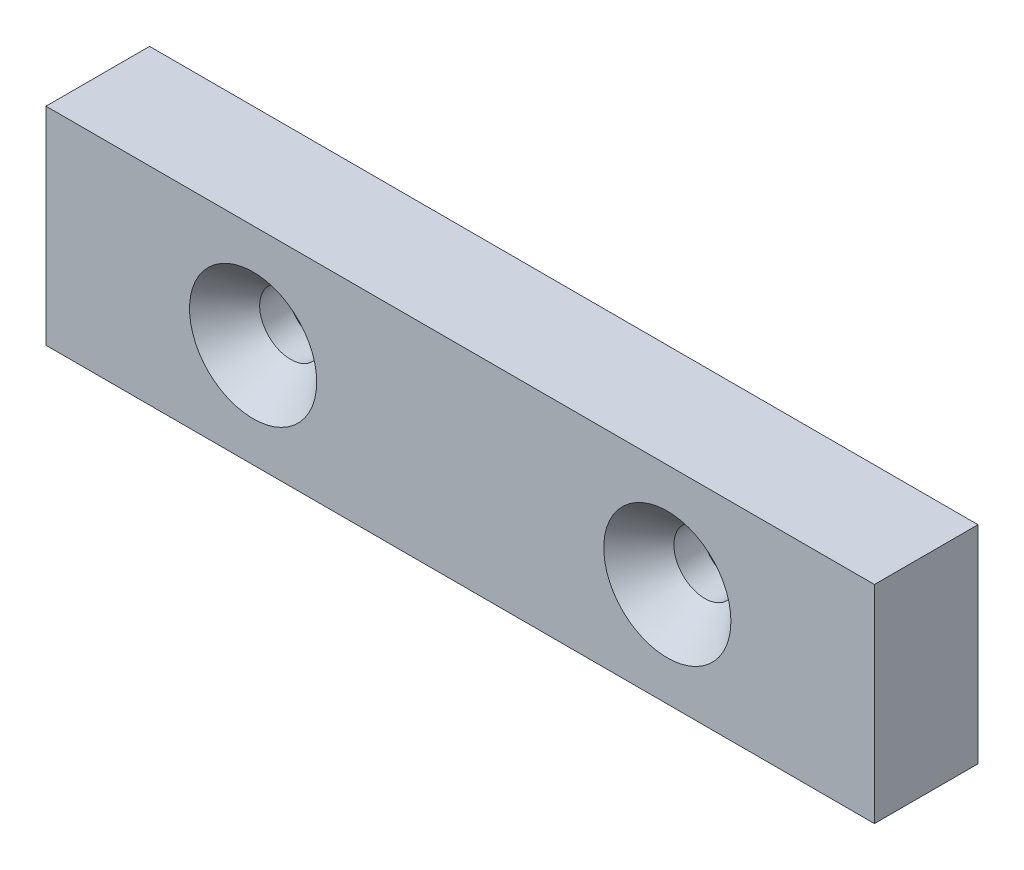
ISO-10303-21;
HEADER;
FILE_DESCRIPTION(('STEP AP214'),'2;1');
FILE_NAME('part.step','',(''),(''),'','','');
FILE_SCHEMA(('AUTOMOTIVE_DESIGN { 1 0 10303 214 1 1 1 1 }'));
ENDSEC;
DATA;
#1=APPLICATION_CONTEXT('core data for automotive mechanical design processes');
#2=APPLICATION_PROTOCOL_DEFINITION('international standard','automotive_design',2000,#1);
#3=PRODUCT_CONTEXT('',#1,'mechanical');
#4=PRODUCT('Part','Part','',(#3));
#5=PRODUCT_RELATED_PRODUCT_CATEGORY('part','',(#4));
#6=PRODUCT_DEFINITION_FORMATION('','',#4);
#7=PRODUCT_DEFINITION_CONTEXT('part definition',#1,'design');
#8=PRODUCT_DEFINITION('design','',#6,#7);
#9=PRODUCT_DEFINITION_SHAPE('','',#8);
#10=(LENGTH_UNIT() NAMED_UNIT(*) SI_UNIT(.MILLI.,.METRE.));
#11=(NAMED_UNIT(*) PLANE_ANGLE_UNIT() SI_UNIT($,.RADIAN.));
#12=(NAMED_UNIT(*) SI_UNIT($,.STERADIAN.) SOLID_ANGLE_UNIT());
#13=UNCERTAINTY_MEASURE_WITH_UNIT(LENGTH_MEASURE(1.E-05),#10,'distance_accuracy_value','');
#14=(GEOMETRIC_REPRESENTATION_CONTEXT(3) GLOBAL_UNCERTAINTY_ASSIGNED_CONTEXT((#13)) GLOBAL_UNIT_ASSIGNED_CONTEXT((#10,
#11,#12)) REPRESENTATION_CONTEXT('',''));
#15=CARTESIAN_POINT('',(0.,0.,0.));
#16=DIRECTION('',(0.,0.,1.));
#17=DIRECTION('',(1.,0.,0.));
#18=AXIS2_PLACEMENT_3D('',#15,#16,#17);
#19=CARTESIAN_POINT('',(25.4000000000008,6.3500000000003,3.17500000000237));
#20=DIRECTION('',(0.,0.,-1.00000000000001));
#21=DIRECTION('',(-1.00000000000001,0.,0.));
#22=AXIS2_PLACEMENT_3D('',#19,#20,#21);
#23=PLANE('',#22);
#24=DIRECTION('',(0.,1.00000000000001,0.));
#25=VECTOR('',#24,1.);
#26=CARTESIAN_POINT('',(25.3999999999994,-6.34999999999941,3.17499999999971));
#27=LINE('',#26,#25);
#28=CARTESIAN_POINT('',(25.3999999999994,-6.34999999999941,3.17499999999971));
#29=VERTEX_POINT('',#28);
#30=CARTESIAN_POINT('',(25.4000000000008,6.3500000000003,3.17500000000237));
#31=VERTEX_POINT('',#30);
#32=EDGE_CURVE('E77',#29,#31,#27,.T.);
#33=ORIENTED_EDGE('',*,*,#32,.T.);
#34=DIRECTION('',(-1.00000000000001,0.,0.));
#35=VECTOR('',#34,1.);
#36=CARTESIAN_POINT('',(-25.399999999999,6.34999999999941,3.17500000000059));
#37=LINE('',#36,#35);
#38=CARTESIAN_POINT('',(-25.399999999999,6.34999999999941,3.17500000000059));
#39=VERTEX_POINT('',#38);
#40=EDGE_CURVE('E85',#31,#39,#37,.T.);
#41=ORIENTED_EDGE('',*,*,#40,.T.);
#42=DIRECTION('',(0.,-1.00000000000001,0.));
#43=VECTOR('',#42,1.);
#44=CARTESIAN_POINT('',(-25.3999999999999,-6.35000000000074,3.17500000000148));
#45=LINE('',#44,#43);
#46=CARTESIAN_POINT('',(-25.3999999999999,-6.35000000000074,3.17500000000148));
#47=VERTEX_POINT('',#46);
#48=EDGE_CURVE('E90',#39,#47,#45,.T.);
#49=ORIENTED_EDGE('',*,*,#48,.T.);
#50=DIRECTION('',(1.00000000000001,0.,0.));
#51=VECTOR('',#50,1.);
#52=CARTESIAN_POINT('',(-25.3999999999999,-6.35000000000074,3.17500000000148));
#53=LINE('',#52,#51);
#54=EDGE_CURVE('E94',#47,#29,#53,.T.);
#55=ORIENTED_EDGE('',*,*,#54,.T.);
#56=EDGE_LOOP('',(#33,#41,#49,#55));
#57=FACE_BOUND('',#56,.T.);
#58=CARTESIAN_POINT('',(12.7000000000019,-2.22044604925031E-12,3.17499999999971));
#59=DIRECTION('',(0.,0.,1.00000000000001));
#60=DIRECTION('',(1.00000000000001,0.,0.));
#61=AXIS2_PLACEMENT_3D('',#58,#59,#60);
#62=CIRCLE('',#61,3.8989);
#63=CARTESIAN_POINT('',(16.598900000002,-2.21568453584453E-12,3.17499999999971));
#64=VERTEX_POINT('',#63);
#65=EDGE_CURVE('E98',#64,#64,#62,.T.);
#66=ORIENTED_EDGE('',*,*,#65,.F.);
#67=EDGE_LOOP('',(#66));
#68=FACE_BOUND('',#67,.T.);
#69=CARTESIAN_POINT('',(-12.6999999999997,0.,3.17500000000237));
#70=DIRECTION('',(0.,0.,1.00000000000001));
#71=DIRECTION('',(1.00000000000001,0.,0.));
#72=AXIS2_PLACEMENT_3D('',#69,#70,#71);
#73=CIRCLE('',#72,3.8989);
#74=CARTESIAN_POINT('',(-8.80109999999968,0.,3.17500000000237));
#75=VERTEX_POINT('',#74);
#76=EDGE_CURVE('E178',#75,#75,#73,.T.);
#77=ORIENTED_EDGE('',*,*,#76,.F.);
#78=EDGE_LOOP('',(#77));
#79=FACE_BOUND('',#78,.T.);
#80=ADVANCED_FACE('F36',(#57,#68,#79),#23,.F.);
#81=CARTESIAN_POINT('',(25.4000000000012,6.34999999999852,-3.17499999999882));
#82=DIRECTION('',(0.,0.,-1.00000000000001));
#83=DIRECTION('',(-1.00000000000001,0.,0.));
#84=AXIS2_PLACEMENT_3D('',#81,#82,#83);
#85=PLANE('',#84);
#86=CARTESIAN_POINT('',(-12.6999999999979,0.,-3.17499999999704));
#87=DIRECTION('',(0.,0.,-1.00000000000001));
#88=DIRECTION('',(-1.00000000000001,0.,0.));
#89=AXIS2_PLACEMENT_3D('',#86,#87,#88);
#90=CIRCLE('',#89,3.8989);
#91=CARTESIAN_POINT('',(-16.598899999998,0.,-3.17499999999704));
#92=VERTEX_POINT('',#91);
#93=EDGE_CURVE('E169',#92,#92,#90,.T.);
#94=ORIENTED_EDGE('',*,*,#93,.F.);
#95=EDGE_LOOP('',(#94));
#96=FACE_BOUND('',#95,.T.);
#97=CARTESIAN_POINT('',(12.6999999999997,-1.77635683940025E-12,-3.17500000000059));
#98=DIRECTION('',(0.,0.,-1.00000000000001));
#99=DIRECTION('',(-1.00000000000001,0.,0.));
#100=AXIS2_PLACEMENT_3D('',#97,#98,#99);
#101=CIRCLE('',#100,3.8989);
#102=CARTESIAN_POINT('',(8.80109999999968,-1.78111835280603E-12,-3.17500000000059));
#103=VERTEX_POINT('',#102);
#104=EDGE_CURVE('E171',#103,#103,#101,.T.);
#105=ORIENTED_EDGE('',*,*,#104,.F.);
#106=EDGE_LOOP('',(#105));
#107=FACE_BOUND('',#106,.T.);
#108=DIRECTION('',(0.,1.00000000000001,0.));
#109=VECTOR('',#108,1.);
#110=CARTESIAN_POINT('',(25.4000000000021,-6.34999999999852,-3.17500000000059));
#111=LINE('',#110,#109);
#112=CARTESIAN_POINT('',(25.4000000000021,-6.34999999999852,-3.17500000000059));
#113=VERTEX_POINT('',#112);
#114=CARTESIAN_POINT('',(25.4000000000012,6.34999999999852,-3.17499999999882));
#115=VERTEX_POINT('',#114);
#116=EDGE_CURVE('E78',#113,#115,#111,.T.);
#117=ORIENTED_EDGE('',*,*,#116,.F.);
#118=DIRECTION('',(1.00000000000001,0.,0.));
#119=VECTOR('',#118,1.);
#120=CARTESIAN_POINT('',(-25.4000000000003,-6.35000000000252,-3.17500000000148));
#121=LINE('',#120,#119);
#122=CARTESIAN_POINT('',(-25.4000000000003,-6.35000000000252,-3.17500000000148));
#123=VERTEX_POINT('',#122);
#124=EDGE_CURVE('E83',#123,#113,#121,.T.);
#125=ORIENTED_EDGE('',*,*,#124,.F.);
#126=DIRECTION('',(0.,-1.00000000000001,0.));
#127=VECTOR('',#126,1.);
#128=CARTESIAN_POINT('',(-25.4000000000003,-6.35000000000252,-3.17500000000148));
#129=LINE('',#128,#127);
#130=CARTESIAN_POINT('',(-25.4000000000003,6.34999999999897,-3.17500000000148));
#131=VERTEX_POINT('',#130);
#132=EDGE_CURVE('E107',#131,#123,#129,.T.);
#133=ORIENTED_EDGE('',*,*,#132,.F.);
#134=DIRECTION('',(-1.00000000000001,0.,0.));
#135=VECTOR('',#134,1.);
#136=CARTESIAN_POINT('',(-25.4000000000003,6.34999999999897,-3.17500000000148));
#137=LINE('',#136,#135);
#138=EDGE_CURVE('E105',#115,#131,#137,.T.);
#139=ORIENTED_EDGE('',*,*,#138,.F.);
#140=EDGE_LOOP('',(#117,#125,#133,#139));
#141=FACE_BOUND('',#140,.T.);
#142=ADVANCED_FACE('F116',(#96,#107,#141),#85,.T.);
#143=CARTESIAN_POINT('',(25.4000000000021,-6.34999999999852,-3.17500000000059));
#144=DIRECTION('',(1.00000000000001,0.,0.));
#145=DIRECTION('',(0.,0.,-1.00000000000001));
#146=AXIS2_PLACEMENT_3D('',#143,#144,#145);
#147=PLANE('',#146);
#148=DIRECTION('',(0.,0.,1.00000000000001));
#149=VECTOR('',#148,1.);
#150=CARTESIAN_POINT('',(25.4000000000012,6.34999999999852,-3.17499999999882));
#151=LINE('',#150,#149);
#152=EDGE_CURVE('E40',#115,#31,#151,.T.);
#153=ORIENTED_EDGE('',*,*,#152,.T.);
#154=ORIENTED_EDGE('',*,*,#32,.F.);
#155=DIRECTION('',(0.,0.,1.00000000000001));
#156=VECTOR('',#155,1.);
#157=CARTESIAN_POINT('',(25.4000000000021,-6.34999999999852,-3.17500000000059));
#158=LINE('',#157,#156);
#159=EDGE_CURVE('E11',#113,#29,#158,.T.);
#160=ORIENTED_EDGE('',*,*,#159,.F.);
#161=ORIENTED_EDGE('',*,*,#116,.T.);
#162=EDGE_LOOP('',(#153,#154,#160,#161));
#163=FACE_BOUND('',#162,.T.);
#164=ADVANCED_FACE('F38',(#163),#147,.T.);
#165=CARTESIAN_POINT('',(-25.4000000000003,-6.35000000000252,-3.17500000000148));
#166=DIRECTION('',(0.,-1.00000000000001,0.));
#167=DIRECTION('',(0.,0.,-1.00000000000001));
#168=AXIS2_PLACEMENT_3D('',#165,#166,#167);
#169=PLANE('',#168);
#170=ORIENTED_EDGE('',*,*,#159,.T.);
#171=ORIENTED_EDGE('',*,*,#54,.F.);
#172=DIRECTION('',(0.,0.,1.00000000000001));
#173=VECTOR('',#172,1.);
#174=CARTESIAN_POINT('',(-25.4000000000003,-6.35000000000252,-3.17500000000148));
#175=LINE('',#174,#173);
#176=EDGE_CURVE('E45',#123,#47,#175,.T.);
#177=ORIENTED_EDGE('',*,*,#176,.F.);
#178=ORIENTED_EDGE('',*,*,#124,.T.);
#179=EDGE_LOOP('',(#170,#171,#177,#178));
#180=FACE_BOUND('',#179,.T.);
#181=ADVANCED_FACE('F114',(#180),#169,.T.);
#182=CARTESIAN_POINT('',(-25.4000000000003,-6.35000000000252,-3.17500000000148));
#183=DIRECTION('',(-1.00000000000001,0.,0.));
#184=DIRECTION('',(0.,0.,1.00000000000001));
#185=AXIS2_PLACEMENT_3D('',#182,#183,#184);
#186=PLANE('',#185);
#187=ORIENTED_EDGE('',*,*,#176,.T.);
#188=ORIENTED_EDGE('',*,*,#48,.F.);
#189=DIRECTION('',(0.,0.,1.00000000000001));
#190=VECTOR('',#189,1.);
#191=CARTESIAN_POINT('',(-25.4000000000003,6.34999999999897,-3.17500000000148));
#192=LINE('',#191,#190);
#193=EDGE_CURVE('E82',#131,#39,#192,.T.);
#194=ORIENTED_EDGE('',*,*,#193,.F.);
#195=ORIENTED_EDGE('',*,*,#132,.T.);
#196=EDGE_LOOP('',(#187,#188,#194,#195));
#197=FACE_BOUND('',#196,.T.);
#198=ADVANCED_FACE('F111',(#197),#186,.T.);
#199=CARTESIAN_POINT('',(-25.4000000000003,6.34999999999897,-3.17500000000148));
#200=DIRECTION('',(0.,1.00000000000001,0.));
#201=DIRECTION('',(0.,0.,1.00000000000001));
#202=AXIS2_PLACEMENT_3D('',#199,#200,#201);
#203=PLANE('',#202);
#204=ORIENTED_EDGE('',*,*,#193,.T.);
#205=ORIENTED_EDGE('',*,*,#40,.F.);
#206=ORIENTED_EDGE('',*,*,#152,.F.);
#207=ORIENTED_EDGE('',*,*,#138,.T.);
#208=EDGE_LOOP('',(#204,#205,#206,#207));
#209=FACE_BOUND('',#208,.T.);
#210=ADVANCED_FACE('F86',(#209),#203,.T.);
#211=CARTESIAN_POINT('',(12.7000000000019,-2.22044604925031E-12,3.17499999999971));
#212=DIRECTION('',(0.,0.,1.00000000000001));
#213=DIRECTION('',(1.00000000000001,0.,0.));
#214=AXIS2_PLACEMENT_3D('',#211,#212,#213);
#215=CYLINDRICAL_SURFACE('',#214,1.89865);
#216=CARTESIAN_POINT('',(12.6999999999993,-1.33226762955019E-12,-0.873975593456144));
#217=DIRECTION('',(0.,0.,-1.00000000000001));
#218=DIRECTION('',(-1.00000000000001,0.,0.));
#219=AXIS2_PLACEMENT_3D('',#216,#217,#218);
#220=CIRCLE('',#219,1.89865);
#221=CARTESIAN_POINT('',(10.8013499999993,-1.33458634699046E-12,-0.873975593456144));
#222=VERTEX_POINT('',#221);
#223=EDGE_CURVE('E176',#222,#222,#220,.T.);
#224=ORIENTED_EDGE('',*,*,#223,.T.);
#225=EDGE_LOOP('',(#224));
#226=FACE_BOUND('',#225,.T.);
#227=CARTESIAN_POINT('',(12.700000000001,4.44089209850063E-13,0.873975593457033));
#228=DIRECTION('',(0.,0.,1.00000000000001));
#229=DIRECTION('',(1.00000000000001,0.,0.));
#230=AXIS2_PLACEMENT_3D('',#227,#228,#229);
#231=CIRCLE('',#230,1.89865);
#232=CARTESIAN_POINT('',(14.5986500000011,4.46407927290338E-13,0.873975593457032));
#233=VERTEX_POINT('',#232);
#234=EDGE_CURVE('E95',#233,#233,#231,.T.);
#235=ORIENTED_EDGE('',*,*,#234,.T.);
#236=EDGE_LOOP('',(#235));
#237=FACE_BOUND('',#236,.T.);
#238=ADVANCED_FACE('F133',(#226,#237),#215,.F.);
#239=CARTESIAN_POINT('',(12.7000000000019,-2.22044604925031E-12,3.17499999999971));
#240=DIRECTION('',(0.,0.,1.00000000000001));
#241=DIRECTION('',(1.00000000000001,0.,0.));
#242=AXIS2_PLACEMENT_3D('',#239,#240,#241);
#243=CONICAL_SURFACE('',#242,3.8989,0.715584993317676);
#244=ORIENTED_EDGE('',*,*,#234,.F.);
#245=EDGE_LOOP('',(#244));
#246=FACE_BOUND('',#245,.T.);
#247=ORIENTED_EDGE('',*,*,#65,.T.);
#248=EDGE_LOOP('',(#247));
#249=FACE_BOUND('',#248,.T.);
#250=ADVANCED_FACE('F137',(#246,#249),#243,.F.);
#251=CARTESIAN_POINT('',(-12.6999999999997,0.,3.17500000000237));
#252=DIRECTION('',(0.,0.,1.00000000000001));
#253=DIRECTION('',(1.00000000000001,0.,0.));
#254=AXIS2_PLACEMENT_3D('',#251,#252,#253);
#255=CYLINDRICAL_SURFACE('',#254,1.89865);
#256=CARTESIAN_POINT('',(-12.6999999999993,0.,-0.873975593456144));
#257=DIRECTION('',(0.,0.,-1.00000000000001));
#258=DIRECTION('',(-1.00000000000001,0.,0.));
#259=AXIS2_PLACEMENT_3D('',#256,#257,#258);
#260=CIRCLE('',#259,1.89865);
#261=CARTESIAN_POINT('',(-14.5986499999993,0.,-0.873975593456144));
#262=VERTEX_POINT('',#261);
#263=EDGE_CURVE('E167',#262,#262,#260,.T.);
#264=ORIENTED_EDGE('',*,*,#263,.T.);
#265=EDGE_LOOP('',(#264));
#266=FACE_BOUND('',#265,.T.);
#267=CARTESIAN_POINT('',(-12.7000000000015,-1.77635683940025E-12,0.873975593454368));
#268=DIRECTION('',(0.,0.,1.00000000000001));
#269=DIRECTION('',(1.00000000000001,0.,0.));
#270=AXIS2_PLACEMENT_3D('',#267,#268,#269);
#271=CIRCLE('',#270,1.89865);
#272=CARTESIAN_POINT('',(-10.8013500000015,-1.77403812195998E-12,0.873975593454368));
#273=VERTEX_POINT('',#272);
#274=EDGE_CURVE('E181',#273,#273,#271,.T.);
#275=ORIENTED_EDGE('',*,*,#274,.T.);
#276=EDGE_LOOP('',(#275));
#277=FACE_BOUND('',#276,.T.);
#278=ADVANCED_FACE('F142',(#266,#277),#255,.F.);
#279=CARTESIAN_POINT('',(-12.6999999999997,0.,3.17500000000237));
#280=DIRECTION('',(0.,0.,1.00000000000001));
#281=DIRECTION('',(1.00000000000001,0.,0.));
#282=AXIS2_PLACEMENT_3D('',#279,#280,#281);
#283=CONICAL_SURFACE('',#282,3.8989,0.715584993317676);
#284=ORIENTED_EDGE('',*,*,#274,.F.);
#285=EDGE_LOOP('',(#284));
#286=FACE_BOUND('',#285,.T.);
#287=ORIENTED_EDGE('',*,*,#76,.T.);
#288=EDGE_LOOP('',(#287));
#289=FACE_BOUND('',#288,.T.);
#290=ADVANCED_FACE('F150',(#286,#289),#283,.F.);
#291=CARTESIAN_POINT('',(12.6999999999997,-1.77635683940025E-12,-3.17500000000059));
#292=DIRECTION('',(0.,0.,-1.00000000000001));
#293=DIRECTION('',(-1.00000000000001,0.,0.));
#294=AXIS2_PLACEMENT_3D('',#291,#292,#293);
#295=CONICAL_SURFACE('',#294,3.8989,0.715584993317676);
#296=ORIENTED_EDGE('',*,*,#223,.F.);
#297=EDGE_LOOP('',(#296));
#298=FACE_BOUND('',#297,.T.);
#299=ORIENTED_EDGE('',*,*,#104,.T.);
#300=EDGE_LOOP('',(#299));
#301=FACE_BOUND('',#300,.T.);
#302=ADVANCED_FACE('F154',(#298,#301),#295,.F.);
#303=CARTESIAN_POINT('',(-12.6999999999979,0.,-3.17499999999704));
#304=DIRECTION('',(0.,0.,-1.00000000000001));
#305=DIRECTION('',(-1.00000000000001,0.,0.));
#306=AXIS2_PLACEMENT_3D('',#303,#304,#305);
#307=CONICAL_SURFACE('',#306,3.8989,0.715584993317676);
#308=ORIENTED_EDGE('',*,*,#263,.F.);
#309=EDGE_LOOP('',(#308));
#310=FACE_BOUND('',#309,.T.);
#311=ORIENTED_EDGE('',*,*,#93,.T.);
#312=EDGE_LOOP('',(#311));
#313=FACE_BOUND('',#312,.T.);
#314=ADVANCED_FACE('F158',(#310,#313),#307,.F.);
#315=CLOSED_SHELL('',(#80,#142,#164,#181,#198,#210,#238,#250,#278,#290,#302,#314));
#316=MANIFOLD_SOLID_BREP('B2',#315);
#317=ADVANCED_BREP_SHAPE_REPRESENTATION('',(#18,#316),#14);
#318=SHAPE_DEFINITION_REPRESENTATION(#9,#317);
ENDSEC;
END-ISO-10303-21;
